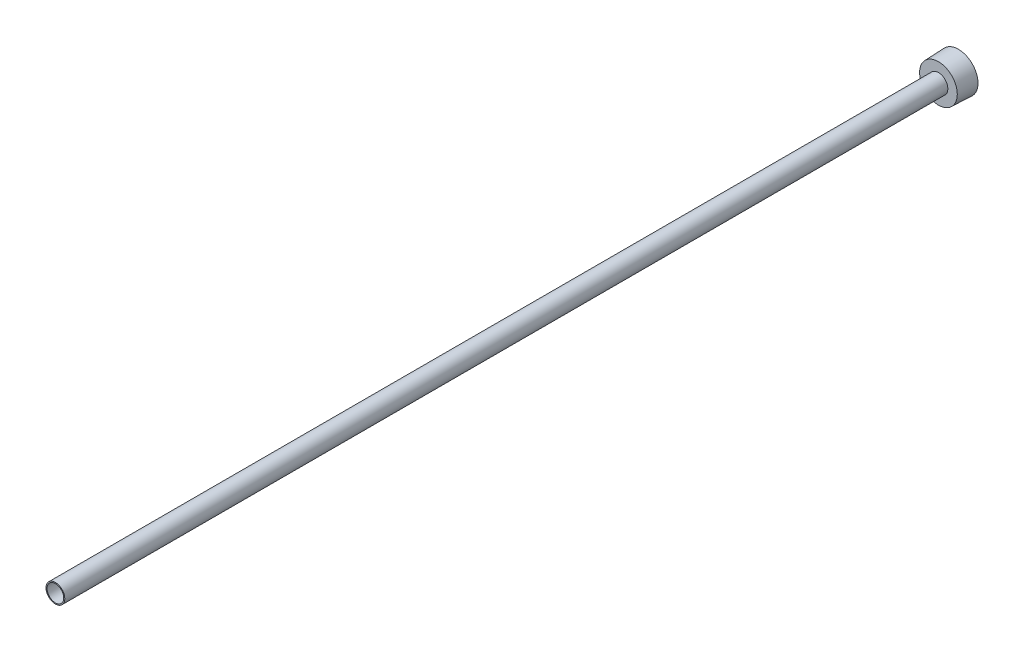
from build123d import *

# Parameters (mm, degrees)
SKETCH2_R          = 5.6388
CUT_EXTRUDE1_DEPTH = 610.886656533
CUT_EXTRUDE2_DEPTH = 9.525


with BuildPart() as part:
    # Sketch1 → Revolve1 (revolve)
    with BuildSketch(Plane(origin=(0, 0, 0), x_dir=(0, 0, -1), z_dir=(1, 0, 0)), mode=Mode.PRIVATE) as revolve1_sk:
        Polygon((-609.6, 0), (0, 0), (0, 13.2207), (-13.4874, 12.728732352), (-13.4874, 6.35), (-609.6, 6.35), align=None)
    revolve(revolve1_sk.sketch.rotate(Axis((0, 0, 278.001114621), (0, 0, -1)), 90), axis=Axis((0, 0, 278.001114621), (0, 0, -1)))

    # Sketch2 → Cut-Extrude1 (cut, through all)
    with BuildSketch(Plane.XY.offset(609.6)):
        Circle(SKETCH2_R)
    extrude(amount=-CUT_EXTRUDE1_DEPTH, mode=Mode.SUBTRACT)

    # Sketch3 → Cut-Extrude2 (cut)
    with BuildSketch(Plane(origin=(0, 0, 0), x_dir=(-1, 0, 0), z_dir=(0, 0, -1))):
        Polygon((0, -10.998522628), (9.525, -5.499261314), (9.525, 5.499261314), (0, 10.998522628), (-9.525, 5.499261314), (-9.525, -5.499261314), align=None)
    extrude(amount=-CUT_EXTRUDE2_DEPTH, mode=Mode.SUBTRACT)


solid = part.part
